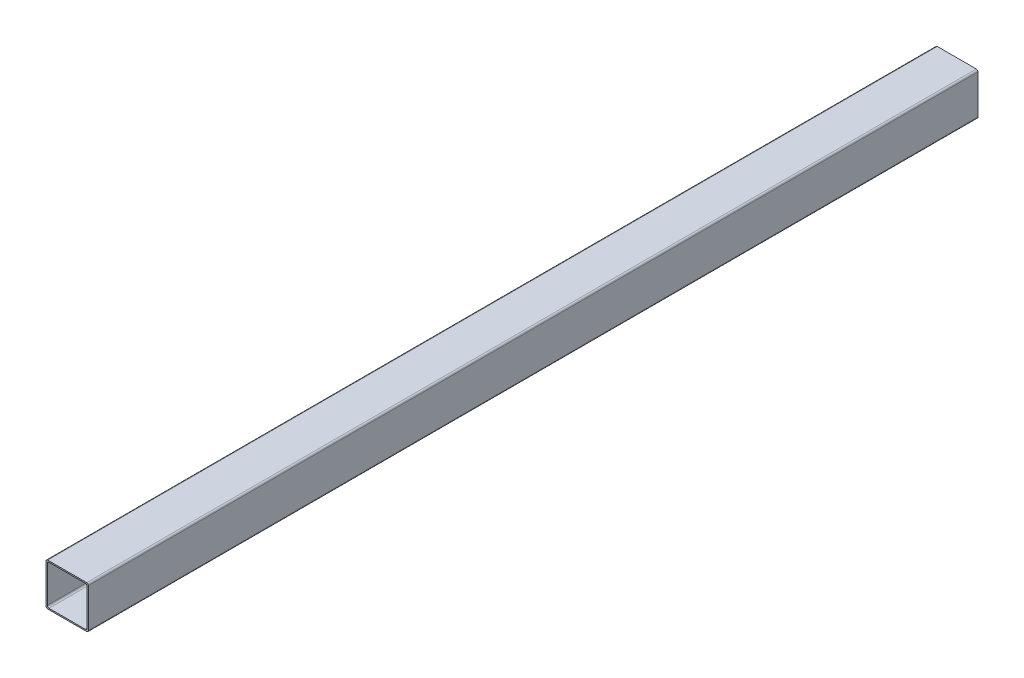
from build123d import *

# Parameters (mm, degrees)
ESQUISSE1_W        = 100
ESQUISSE1_H        = 100
ESQUISSE1_W_2      = 94
ESQUISSE1_H_2      = 94
EXTRU_MINCE1_DEPTH = 2100
CONG_1_R           = 4


with BuildPart() as part:
    # Esquisse1 → Extru.-Mince1 (new body)
    with BuildSketch(Plane.XY):
        with Locations((50, 50)):
            Rectangle(ESQUISSE1_W, ESQUISSE1_H)
        with Locations((50, 50)):
            Rectangle(ESQUISSE1_W_2, ESQUISSE1_H_2, mode=Mode.SUBTRACT)
    extrude(amount=EXTRU_MINCE1_DEPTH)

    # Cong_1
    cong_1_edges = [part.edges().sort_by_distance(p)[0] for p in [
        (3, 97, 1050),
        (3, 3, 1050),
        (97, 3, 1050),
        (97, 97, 1050),
        (0, 100, 1050),
        (100, 100, 1050),
        (100, 0, 1050),
        (0, 0, 1050),
    ]]
    fillet(cong_1_edges, radius=CONG_1_R)


solid = part.part
